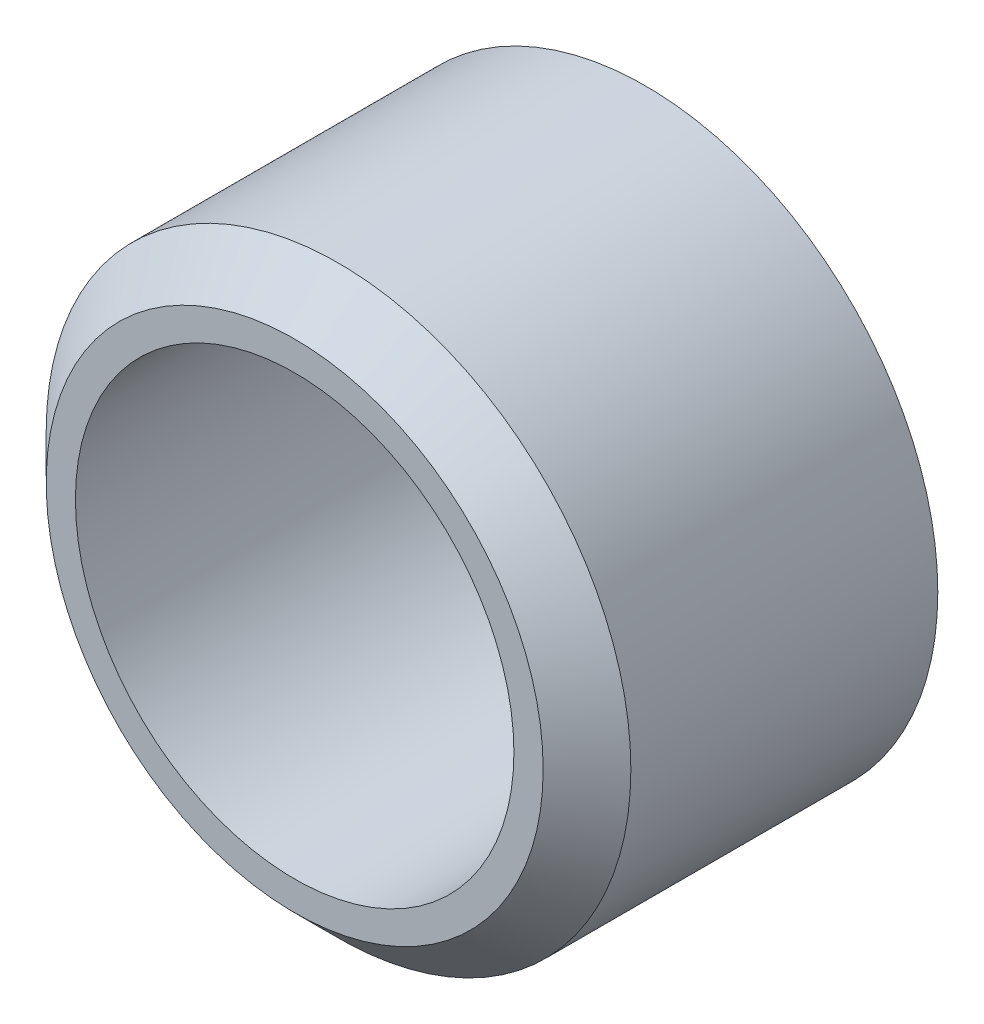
ISO-10303-21;
HEADER;
FILE_DESCRIPTION(('STEP AP214'),'2;1');
FILE_NAME('part.step','',(''),(''),'','','');
FILE_SCHEMA(('AUTOMOTIVE_DESIGN { 1 0 10303 214 1 1 1 1 }'));
ENDSEC;
DATA;
#1=APPLICATION_CONTEXT('core data for automotive mechanical design processes');
#2=APPLICATION_PROTOCOL_DEFINITION('international standard','automotive_design',2000,#1);
#3=PRODUCT_CONTEXT('',#1,'mechanical');
#4=PRODUCT('Part','Part','',(#3));
#5=PRODUCT_RELATED_PRODUCT_CATEGORY('part','',(#4));
#6=PRODUCT_DEFINITION_FORMATION('','',#4);
#7=PRODUCT_DEFINITION_CONTEXT('part definition',#1,'design');
#8=PRODUCT_DEFINITION('design','',#6,#7);
#9=PRODUCT_DEFINITION_SHAPE('','',#8);
#10=(LENGTH_UNIT() NAMED_UNIT(*) SI_UNIT(.MILLI.,.METRE.));
#11=(NAMED_UNIT(*) PLANE_ANGLE_UNIT() SI_UNIT($,.RADIAN.));
#12=(NAMED_UNIT(*) SI_UNIT($,.STERADIAN.) SOLID_ANGLE_UNIT());
#13=UNCERTAINTY_MEASURE_WITH_UNIT(LENGTH_MEASURE(1.E-05),#10,'distance_accuracy_value','');
#14=(GEOMETRIC_REPRESENTATION_CONTEXT(3) GLOBAL_UNCERTAINTY_ASSIGNED_CONTEXT((#13)) GLOBAL_UNIT_ASSIGNED_CONTEXT((#10,
#11,#12)) REPRESENTATION_CONTEXT('',''));
#15=CARTESIAN_POINT('',(0.,0.,0.));
#16=DIRECTION('',(0.,0.,1.));
#17=DIRECTION('',(1.,0.,0.));
#18=AXIS2_PLACEMENT_3D('',#15,#16,#17);
#19=CARTESIAN_POINT('',(0.,0.,24.));
#20=DIRECTION('',(0.,0.,1.));
#21=DIRECTION('',(1.,0.,0.));
#22=AXIS2_PLACEMENT_3D('',#19,#20,#21);
#23=PLANE('',#22);
#24=CARTESIAN_POINT('',(0.,0.,24.));
#25=DIRECTION('',(0.,0.,1.));
#26=DIRECTION('',(1.,0.,0.));
#27=AXIS2_PLACEMENT_3D('',#24,#25,#26);
#28=CIRCLE('',#27,17.);
#29=CARTESIAN_POINT('',(17.,0.,24.));
#30=VERTEX_POINT('',#29);
#31=EDGE_CURVE('E38',#30,#30,#28,.T.);
#32=ORIENTED_EDGE('',*,*,#31,.T.);
#33=EDGE_LOOP('',(#32));
#34=FACE_BOUND('',#33,.T.);
#35=CARTESIAN_POINT('',(0.,0.,24.));
#36=DIRECTION('',(0.,0.,1.));
#37=DIRECTION('',(1.,0.,0.));
#38=AXIS2_PLACEMENT_3D('',#35,#36,#37);
#39=CIRCLE('',#38,15.);
#40=CARTESIAN_POINT('',(15.,0.,24.));
#41=VERTEX_POINT('',#40);
#42=EDGE_CURVE('E46',#41,#41,#39,.T.);
#43=ORIENTED_EDGE('',*,*,#42,.F.);
#44=EDGE_LOOP('',(#43));
#45=FACE_BOUND('',#44,.T.);
#46=ADVANCED_FACE('F31',(#34,#45),#23,.T.);
#47=CARTESIAN_POINT('',(0.,0.,0.));
#48=DIRECTION('',(0.,0.,1.));
#49=DIRECTION('',(1.,0.,0.));
#50=AXIS2_PLACEMENT_3D('',#47,#48,#49);
#51=PLANE('',#50);
#52=CARTESIAN_POINT('',(0.,0.,0.));
#53=DIRECTION('',(0.,0.,1.));
#54=DIRECTION('',(1.,0.,0.));
#55=AXIS2_PLACEMENT_3D('',#52,#53,#54);
#56=CIRCLE('',#55,20.);
#57=CARTESIAN_POINT('',(20.,0.,0.));
#58=VERTEX_POINT('',#57);
#59=EDGE_CURVE('E42',#58,#58,#56,.T.);
#60=ORIENTED_EDGE('',*,*,#59,.F.);
#61=EDGE_LOOP('',(#60));
#62=FACE_BOUND('',#61,.T.);
#63=CARTESIAN_POINT('',(0.,0.,0.));
#64=DIRECTION('',(0.,0.,1.));
#65=DIRECTION('',(1.,0.,0.));
#66=AXIS2_PLACEMENT_3D('',#63,#64,#65);
#67=CIRCLE('',#66,15.);
#68=CARTESIAN_POINT('',(15.,0.,0.));
#69=VERTEX_POINT('',#68);
#70=EDGE_CURVE('E49',#69,#69,#67,.T.);
#71=ORIENTED_EDGE('',*,*,#70,.T.);
#72=EDGE_LOOP('',(#71));
#73=FACE_BOUND('',#72,.T.);
#74=ADVANCED_FACE('F59',(#62,#73),#51,.F.);
#75=CARTESIAN_POINT('',(0.,0.,24.));
#76=DIRECTION('',(0.,0.,-1.));
#77=DIRECTION('',(-1.,0.,0.));
#78=AXIS2_PLACEMENT_3D('',#75,#76,#77);
#79=CYLINDRICAL_SURFACE('',#78,20.);
#80=CARTESIAN_POINT('',(0.,0.,21.));
#81=DIRECTION('',(0.,0.,1.));
#82=DIRECTION('',(1.,0.,0.));
#83=AXIS2_PLACEMENT_3D('',#80,#81,#82);
#84=CIRCLE('',#83,20.);
#85=CARTESIAN_POINT('',(20.,0.,21.));
#86=VERTEX_POINT('',#85);
#87=EDGE_CURVE('E10',#86,#86,#84,.F.);
#88=ORIENTED_EDGE('',*,*,#87,.T.);
#89=EDGE_LOOP('',(#88));
#90=FACE_BOUND('',#89,.T.);
#91=ORIENTED_EDGE('',*,*,#59,.T.);
#92=EDGE_LOOP('',(#91));
#93=FACE_BOUND('',#92,.T.);
#94=ADVANCED_FACE('F64',(#90,#93),#79,.T.);
#95=CARTESIAN_POINT('',(0.,0.,24.));
#96=DIRECTION('',(0.,0.,-1.));
#97=DIRECTION('',(-1.,0.,0.));
#98=AXIS2_PLACEMENT_3D('',#95,#96,#97);
#99=CYLINDRICAL_SURFACE('',#98,15.);
#100=ORIENTED_EDGE('',*,*,#42,.T.);
#101=EDGE_LOOP('',(#100));
#102=FACE_BOUND('',#101,.T.);
#103=ORIENTED_EDGE('',*,*,#70,.F.);
#104=EDGE_LOOP('',(#103));
#105=FACE_BOUND('',#104,.T.);
#106=ADVANCED_FACE('F55',(#102,#105),#99,.F.);
#107=CARTESIAN_POINT('',(0.,0.,24.));
#108=DIRECTION('',(0.,0.,-1.));
#109=DIRECTION('',(-1.,0.,0.));
#110=AXIS2_PLACEMENT_3D('',#107,#108,#109);
#111=CONICAL_SURFACE('',#110,17.,0.785398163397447);
#112=ORIENTED_EDGE('',*,*,#87,.F.);
#113=EDGE_LOOP('',(#112));
#114=FACE_BOUND('',#113,.T.);
#115=ORIENTED_EDGE('',*,*,#31,.F.);
#116=EDGE_LOOP('',(#115));
#117=FACE_BOUND('',#116,.T.);
#118=ADVANCED_FACE('F33',(#114,#117),#111,.T.);
#119=CLOSED_SHELL('',(#46,#74,#94,#106,#118));
#120=MANIFOLD_SOLID_BREP('B2',#119);
#121=ADVANCED_BREP_SHAPE_REPRESENTATION('',(#18,#120),#14);
#122=SHAPE_DEFINITION_REPRESENTATION(#9,#121);
ENDSEC;
END-ISO-10303-21;
